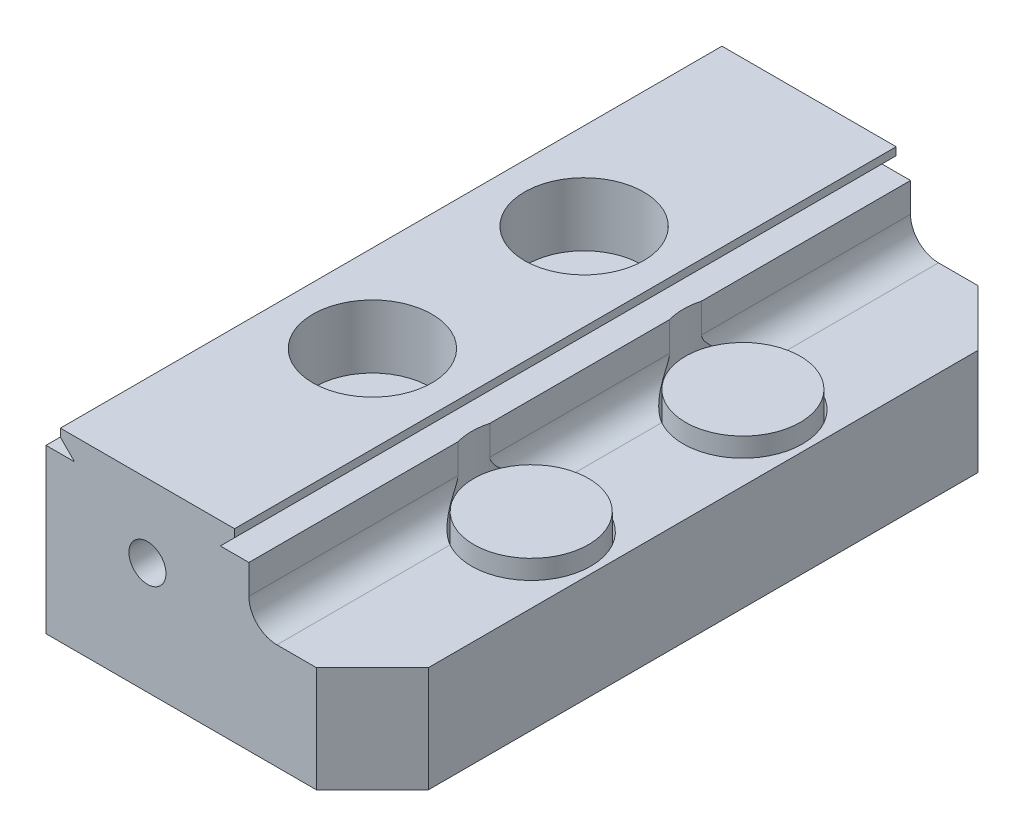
ISO-10303-21;
HEADER;
FILE_DESCRIPTION(('STEP AP214'),'2;1');
FILE_NAME('part.step','',(''),(''),'','','');
FILE_SCHEMA(('AUTOMOTIVE_DESIGN { 1 0 10303 214 1 1 1 1 }'));
ENDSEC;
DATA;
#1=APPLICATION_CONTEXT('core data for automotive mechanical design processes');
#2=APPLICATION_PROTOCOL_DEFINITION('international standard','automotive_design',2000,#1);
#3=PRODUCT_CONTEXT('',#1,'mechanical');
#4=PRODUCT('Part','Part','',(#3));
#5=PRODUCT_RELATED_PRODUCT_CATEGORY('part','',(#4));
#6=PRODUCT_DEFINITION_FORMATION('','',#4);
#7=PRODUCT_DEFINITION_CONTEXT('part definition',#1,'design');
#8=PRODUCT_DEFINITION('design','',#6,#7);
#9=PRODUCT_DEFINITION_SHAPE('','',#8);
#10=(LENGTH_UNIT() NAMED_UNIT(*) SI_UNIT(.MILLI.,.METRE.));
#11=(NAMED_UNIT(*) PLANE_ANGLE_UNIT() SI_UNIT($,.RADIAN.));
#12=(NAMED_UNIT(*) SI_UNIT($,.STERADIAN.) SOLID_ANGLE_UNIT());
#13=UNCERTAINTY_MEASURE_WITH_UNIT(LENGTH_MEASURE(1.E-05),#10,'distance_accuracy_value','');
#14=(GEOMETRIC_REPRESENTATION_CONTEXT(3) GLOBAL_UNCERTAINTY_ASSIGNED_CONTEXT((#13)) GLOBAL_UNIT_ASSIGNED_CONTEXT((#10,
#11,#12)) REPRESENTATION_CONTEXT('',''));
#15=CARTESIAN_POINT('',(0.,0.,0.));
#16=DIRECTION('',(0.,0.,1.));
#17=DIRECTION('',(1.,0.,0.));
#18=AXIS2_PLACEMENT_3D('',#15,#16,#17);
#19=CARTESIAN_POINT('',(26.175,15.175,37.5));
#20=DIRECTION('',(0.,0.,-1.));
#21=DIRECTION('',(-1.,0.,0.));
#22=AXIS2_PLACEMENT_3D('',#19,#20,#21);
#23=CYLINDRICAL_SURFACE('',#22,3.175);
#24=DIRECTION('',(0.,0.,-1.));
#25=VECTOR('',#24,1.);
#26=CARTESIAN_POINT('',(23.,15.175,37.5));
#27=LINE('',#26,#25);
#28=CARTESIAN_POINT('',(23.,15.175,-13.8200274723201));
#29=VERTEX_POINT('',#28);
#30=CARTESIAN_POINT('',(23.,15.175,-37.5));
#31=VERTEX_POINT('',#30);
#32=EDGE_CURVE('E443',#29,#31,#27,.T.);
#33=ORIENTED_EDGE('',*,*,#32,.F.);
#34=CARTESIAN_POINT('',(23.,15.175,-13.8200274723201));
#35=CARTESIAN_POINT('',(22.9999604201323,15.1198926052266,-13.8198230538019));
#36=CARTESIAN_POINT('',(23.0014321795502,15.0651093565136,-13.8251482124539));
#37=CARTESIAN_POINT('',(23.0069716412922,14.9582999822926,-13.8447873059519));
#38=CARTESIAN_POINT('',(23.010991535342,14.9062418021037,-13.8589356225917));
#39=CARTESIAN_POINT('',(23.0236021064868,14.7813863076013,-13.9024842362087));
#40=CARTESIAN_POINT('',(23.0334482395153,14.7101765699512,-13.9359155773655));
#41=CARTESIAN_POINT('',(23.0567939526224,14.5730841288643,-14.012268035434));
#42=CARTESIAN_POINT('',(23.0703289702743,14.5072615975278,-14.0552804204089));
#43=CARTESIAN_POINT('',(23.106677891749,14.3536358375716,-14.1662407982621));
#44=CARTESIAN_POINT('',(23.1309960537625,14.2682952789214,-14.2370461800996));
#45=CARTESIAN_POINT('',(23.1847003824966,14.1044135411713,-14.3844734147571));
#46=CARTESIAN_POINT('',(23.2140973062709,14.0258873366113,-14.4611074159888));
#47=CARTESIAN_POINT('',(23.2776989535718,13.8738169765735,-14.6177545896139));
#48=CARTESIAN_POINT('',(23.3119186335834,13.8002894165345,-14.6977777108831));
#49=CARTESIAN_POINT('',(23.3849318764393,13.6575831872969,-14.8594259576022));
#50=CARTESIAN_POINT('',(23.4237216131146,13.5884009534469,-14.9410496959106));
#51=CARTESIAN_POINT('',(23.5313207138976,13.412071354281,-15.1558508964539));
#52=CARTESIAN_POINT('',(23.6038482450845,13.3079348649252,-15.289661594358));
#53=CARTESIAN_POINT('',(23.7611169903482,13.108627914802,-15.5569409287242));
#54=CARTESIAN_POINT('',(23.8458672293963,13.0134641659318,-15.6904092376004));
#55=CARTESIAN_POINT('',(24.0276053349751,12.8328481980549,-15.9548760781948));
#56=CARTESIAN_POINT('',(24.1245562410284,12.7473680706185,-16.0858807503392));
#57=CARTESIAN_POINT('',(24.3311421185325,12.5869650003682,-16.3442854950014));
#58=CARTESIAN_POINT('',(24.4407773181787,12.5120422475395,-16.4716855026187));
#59=CARTESIAN_POINT('',(24.7127713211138,12.3509448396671,-16.7641530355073));
#60=CARTESIAN_POINT('',(24.8803498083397,12.2696644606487,-16.9272274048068));
#61=CARTESIAN_POINT('',(25.1482546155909,12.1690923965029,-17.1612865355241));
#62=CARTESIAN_POINT('',(25.2401917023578,12.139149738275,-17.237462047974));
#63=CARTESIAN_POINT('',(25.4293742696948,12.087236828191,-17.3858081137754));
#64=CARTESIAN_POINT('',(25.526616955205,12.0652624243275,-17.4579807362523));
#65=CARTESIAN_POINT('',(25.7142314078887,12.032344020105,-17.589452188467));
#66=CARTESIAN_POINT('',(25.8040662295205,12.0204067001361,-17.6492668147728));
#67=CARTESIAN_POINT('',(25.9871409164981,12.0042276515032,-17.7649044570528));
#68=CARTESIAN_POINT('',(26.0803861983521,11.9999987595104,-17.8207206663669));
#69=CARTESIAN_POINT('',(26.175,12.,-17.8742552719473));
#70=B_SPLINE_CURVE_WITH_KNOTS('',3,(#34,#35,#36,#37,#38,#39,#40,#41,#42,#43,#44,#45,#46,#47,#48,
#49,#50,#51,#52,#53,#54,#55,#56,#57,#58,#59,#60,#61,#62,#63,#64,#65,#66,#67,#68,#69),
.UNSPECIFIED.,.F.,.F.,(4,2,2,2,2,2,2,2,2,2,2,2,2,2,2,2,2,4),(0.,0.164529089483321,
0.326059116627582,0.562554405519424,0.801406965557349,1.14117317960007,1.4816680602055,
1.82324313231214,2.16453423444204,2.71710856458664,3.27009301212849,3.82144086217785,
4.37279863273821,5.11243321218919,5.48136248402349,5.85009924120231,6.17546973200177,
6.50138156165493),.UNSPECIFIED.);
#71=CARTESIAN_POINT('',(26.175,12.,-17.8742552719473));
#72=VERTEX_POINT('',#71);
#73=EDGE_CURVE('E354',#29,#72,#70,.T.);
#74=ORIENTED_EDGE('',*,*,#73,.T.);
#75=DIRECTION('',(0.,0.,-1.));
#76=VECTOR('',#75,1.);
#77=CARTESIAN_POINT('',(26.175,12.,37.5));
#78=LINE('',#77,#76);
#79=CARTESIAN_POINT('',(26.175,12.,-37.5));
#80=VERTEX_POINT('',#79);
#81=EDGE_CURVE('E448',#72,#80,#78,.T.);
#82=ORIENTED_EDGE('',*,*,#81,.T.);
#83=CARTESIAN_POINT('',(26.175,15.175,-37.5));
#84=DIRECTION('',(0.,0.,-1.));
#85=DIRECTION('',(1.,0.,0.));
#86=AXIS2_PLACEMENT_3D('',#83,#84,#85);
#87=CIRCLE('',#86,3.175);
#88=EDGE_CURVE('E400',#80,#31,#87,.T.);
#89=ORIENTED_EDGE('',*,*,#88,.T.);
#90=EDGE_LOOP('',(#33,#74,#82,#89));
#91=FACE_BOUND('',#90,.T.);
#92=ADVANCED_FACE('F16',(#91),#23,.F.);
#93=CARTESIAN_POINT('',(26.175,12.,6.12574472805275));
#94=VERTEX_POINT('',#93);
#95=CARTESIAN_POINT('',(26.175,12.,-6.12574472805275));
#96=VERTEX_POINT('',#95);
#97=EDGE_CURVE('E454',#94,#96,#78,.T.);
#98=ORIENTED_EDGE('',*,*,#97,.T.);
#99=CARTESIAN_POINT('',(26.175,12.,-6.12574472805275));
#100=CARTESIAN_POINT('',(26.0554497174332,11.9999995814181,-6.1933653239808));
#101=CARTESIAN_POINT('',(25.9381345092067,12.0067473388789,-6.26463219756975));
#102=CARTESIAN_POINT('',(25.7092088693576,12.0322484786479,-6.41333435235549));
#103=CARTESIAN_POINT('',(25.5975856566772,12.0509735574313,-6.49075471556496));
#104=CARTESIAN_POINT('',(25.3823102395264,12.0985976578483,-6.64978247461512));
#105=CARTESIAN_POINT('',(25.2785645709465,12.1273421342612,-6.73131102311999));
#106=CARTESIAN_POINT('',(25.0776404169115,12.1937872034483,-6.89878985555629));
#107=CARTESIAN_POINT('',(24.9804663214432,12.2314937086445,-6.98474302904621));
#108=CARTESIAN_POINT('',(24.7775413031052,12.3215793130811,-7.17472724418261));
#109=CARTESIAN_POINT('',(24.6730153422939,12.3753523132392,-7.27940343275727));
#110=CARTESIAN_POINT('',(24.473387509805,12.4919963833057,-7.4925619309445));
#111=CARTESIAN_POINT('',(24.3782865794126,12.5548683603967,-7.60104461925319));
#112=CARTESIAN_POINT('',(24.1966848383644,12.6890901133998,-7.82173086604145));
#113=CARTESIAN_POINT('',(24.1102603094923,12.7605047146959,-7.93395751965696));
#114=CARTESIAN_POINT('',(23.9467435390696,12.9105334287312,-8.16029550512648));
#115=CARTESIAN_POINT('',(23.8696489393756,12.9891457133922,-8.27440635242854));
#116=CARTESIAN_POINT('',(23.7222644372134,13.1557235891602,-8.50717434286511));
#117=CARTESIAN_POINT('',(23.6522669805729,13.2439064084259,-8.62586110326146));
#118=CARTESIAN_POINT('',(23.5217109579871,13.4276026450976,-8.86297907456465));
#119=CARTESIAN_POINT('',(23.4611625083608,13.5231237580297,-8.98140987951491));
#120=CARTESIAN_POINT('',(23.3498895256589,13.7216298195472,-9.21518170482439));
#121=CARTESIAN_POINT('',(23.2991014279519,13.8245600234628,-9.33053818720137));
#122=CARTESIAN_POINT('',(23.2301845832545,13.986680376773,-9.49887841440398));
#123=CARTESIAN_POINT('',(23.2084392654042,14.0419555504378,-9.55416243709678));
#124=CARTESIAN_POINT('',(23.167460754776,14.1556900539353,-9.66231378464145));
#125=CARTESIAN_POINT('',(23.1482262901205,14.2141477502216,-9.71518232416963));
#126=CARTESIAN_POINT('',(23.1127099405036,14.3342410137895,-9.81645613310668));
#127=CARTESIAN_POINT('',(23.0963909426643,14.3958215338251,-9.86491296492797));
#128=CARTESIAN_POINT('',(23.066760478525,14.5240020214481,-9.95593418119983));
#129=CARTESIAN_POINT('',(23.0534478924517,14.5906001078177,-9.99850075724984));
#130=CARTESIAN_POINT('',(23.0335018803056,14.7120066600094,-10.0640852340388));
#131=CARTESIAN_POINT('',(23.0260311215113,14.7654565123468,-10.0893167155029));
#132=CARTESIAN_POINT('',(23.0136624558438,14.8756478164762,-10.131734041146));
#133=CARTESIAN_POINT('',(23.0087535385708,14.9323739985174,-10.148954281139));
#134=CARTESIAN_POINT('',(23.0036143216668,15.0205356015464,-10.167101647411));
#135=CARTESIAN_POINT('',(23.0022692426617,15.0511266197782,-10.1718824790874));
#136=CARTESIAN_POINT('',(23.0004575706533,15.112800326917,-10.1783381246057));
#137=CARTESIAN_POINT('',(22.9999950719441,15.1438846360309,-10.1799984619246));
#138=CARTESIAN_POINT('',(23.,15.175,-10.1799725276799));
#139=B_SPLINE_CURVE_WITH_KNOTS('',3,(#99,#100,#101,#102,#103,#104,#105,#106,#107,#108,#109,#110,
#111,#112,#113,#114,#115,#116,#117,#118,#119,#120,#121,#122,#123,#124,#125,#126,#127,#128,#129,
#130,#131,#132,#133,#134,#135,#136,#137,#138),.UNSPECIFIED.,.F.,.F.,(4,2,2,2,2,2,2,2,2,2,2,2,2,
2,2,2,2,2,2,4),(0.,0.411600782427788,0.822232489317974,1.22679184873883,1.63161884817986,
2.10314870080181,2.57472559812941,3.05013999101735,3.52543397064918,4.01576489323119,
4.50661722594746,4.9941556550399,5.23749349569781,5.48070759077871,5.72056228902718,
5.96032750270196,6.13858208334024,6.31606410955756,6.40887954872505,6.50212452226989),.UNSPECIFIED.);
#140=CARTESIAN_POINT('',(23.,15.175,-10.1799725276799));
#141=VERTEX_POINT('',#140);
#142=EDGE_CURVE('E347',#96,#141,#139,.T.);
#143=ORIENTED_EDGE('',*,*,#142,.T.);
#144=CARTESIAN_POINT('',(23.,15.175,10.1799725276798));
#145=VERTEX_POINT('',#144);
#146=EDGE_CURVE('E449',#145,#141,#27,.T.);
#147=ORIENTED_EDGE('',*,*,#146,.F.);
#148=CARTESIAN_POINT('',(23.,15.175,10.1799725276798));
#149=CARTESIAN_POINT('',(22.9999604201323,15.1198926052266,10.1801769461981));
#150=CARTESIAN_POINT('',(23.0014321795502,15.0651093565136,10.1748517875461));
#151=CARTESIAN_POINT('',(23.0069716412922,14.9582999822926,10.1552126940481));
#152=CARTESIAN_POINT('',(23.010991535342,14.9062418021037,10.1410643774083));
#153=CARTESIAN_POINT('',(23.0236021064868,14.7813863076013,10.0975157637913));
#154=CARTESIAN_POINT('',(23.0334482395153,14.7101765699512,10.0640844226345));
#155=CARTESIAN_POINT('',(23.0567939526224,14.5730841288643,9.98773196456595));
#156=CARTESIAN_POINT('',(23.0703289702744,14.5072615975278,9.94471957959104));
#157=CARTESIAN_POINT('',(23.1066778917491,14.3536358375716,9.83375920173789));
#158=CARTESIAN_POINT('',(23.1309960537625,14.2682952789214,9.76295381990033));
#159=CARTESIAN_POINT('',(23.1847003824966,14.1044135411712,9.61552658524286));
#160=CARTESIAN_POINT('',(23.2140973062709,14.0258873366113,9.53889258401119));
#161=CARTESIAN_POINT('',(23.2776989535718,13.8738169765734,9.38224541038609));
#162=CARTESIAN_POINT('',(23.3119186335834,13.8002894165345,9.30222228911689));
#163=CARTESIAN_POINT('',(23.3849318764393,13.6575831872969,9.14057404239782));
#164=CARTESIAN_POINT('',(23.4237216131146,13.5884009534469,9.05895030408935));
#165=CARTESIAN_POINT('',(23.5313207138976,13.412071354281,8.8441491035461));
#166=CARTESIAN_POINT('',(23.6038482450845,13.3079348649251,8.710338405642));
#167=CARTESIAN_POINT('',(23.7611169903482,13.108627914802,8.44305907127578));
#168=CARTESIAN_POINT('',(23.8458672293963,13.0134641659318,8.30959076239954));
#169=CARTESIAN_POINT('',(24.0276053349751,12.8328481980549,8.04512392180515));
#170=CARTESIAN_POINT('',(24.1245562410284,12.7473680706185,7.91411924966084));
#171=CARTESIAN_POINT('',(24.3311421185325,12.5869650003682,7.65571450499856));
#172=CARTESIAN_POINT('',(24.4407773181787,12.5120422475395,7.52831449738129));
#173=CARTESIAN_POINT('',(24.7127713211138,12.3509448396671,7.23584696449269));
#174=CARTESIAN_POINT('',(24.8803498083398,12.2696644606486,7.07277259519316));
#175=CARTESIAN_POINT('',(25.1482546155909,12.1690923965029,6.83871346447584));
#176=CARTESIAN_POINT('',(25.2401917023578,12.139149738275,6.76253795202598));
#177=CARTESIAN_POINT('',(25.4293742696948,12.087236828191,6.61419188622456));
#178=CARTESIAN_POINT('',(25.526616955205,12.0652624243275,6.54201926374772));
#179=CARTESIAN_POINT('',(25.7142314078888,12.032344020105,6.410547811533));
#180=CARTESIAN_POINT('',(25.8040662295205,12.0204067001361,6.35073318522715));
#181=CARTESIAN_POINT('',(25.9871409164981,12.0042276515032,6.23509554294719));
#182=CARTESIAN_POINT('',(26.0803861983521,11.9999987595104,6.17927933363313));
#183=CARTESIAN_POINT('',(26.175,12.,6.12574472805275));
#184=B_SPLINE_CURVE_WITH_KNOTS('',3,(#148,#149,#150,#151,#152,#153,#154,#155,#156,#157,#158,
#159,#160,#161,#162,#163,#164,#165,#166,#167,#168,#169,#170,#171,#172,#173,#174,#175,#176,#177,
#178,#179,#180,#181,#182,#183),.UNSPECIFIED.,.F.,.F.,(4,2,2,2,2,2,2,2,2,2,2,2,2,2,2,2,2,4),(0.,
0.164529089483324,0.326059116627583,0.56255440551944,0.801406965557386,1.14117317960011,
1.48166806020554,1.82324313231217,2.16453423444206,2.71710856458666,3.2700930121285,
3.82144086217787,4.37279863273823,5.11243321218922,5.48136248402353,5.85009924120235,
6.17546973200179,6.50138156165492),.UNSPECIFIED.);
#185=EDGE_CURVE('E313',#145,#94,#184,.T.);
#186=ORIENTED_EDGE('',*,*,#185,.T.);
#187=EDGE_LOOP('',(#98,#143,#147,#186));
#188=FACE_BOUND('',#187,.T.);
#189=ADVANCED_FACE('F522',(#188),#23,.F.);
#190=CARTESIAN_POINT('',(23.,18.5,37.5));
#191=DIRECTION('',(-1.,0.,0.));
#192=DIRECTION('',(0.,0.,1.));
#193=AXIS2_PLACEMENT_3D('',#190,#191,#192);
#194=PLANE('',#193);
#195=ORIENTED_EDGE('',*,*,#146,.T.);
#196=DIRECTION('',(0.,1.,0.));
#197=VECTOR('',#196,1.);
#198=CARTESIAN_POINT('',(23.,6.,-10.1799725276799));
#199=LINE('',#198,#197);
#200=CARTESIAN_POINT('',(23.,18.5,-10.1799725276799));
#201=VERTEX_POINT('',#200);
#202=EDGE_CURVE('E475',#141,#201,#199,.T.);
#203=ORIENTED_EDGE('',*,*,#202,.T.);
#204=DIRECTION('',(0.,0.,-1.));
#205=VECTOR('',#204,1.);
#206=CARTESIAN_POINT('',(23.,18.5,37.5));
#207=LINE('',#206,#205);
#208=CARTESIAN_POINT('',(23.,18.5,10.1799725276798));
#209=VERTEX_POINT('',#208);
#210=EDGE_CURVE('E444',#209,#201,#207,.T.);
#211=ORIENTED_EDGE('',*,*,#210,.F.);
#212=DIRECTION('',(0.,1.,0.));
#213=VECTOR('',#212,1.);
#214=CARTESIAN_POINT('',(23.,6.,10.1799725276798));
#215=LINE('',#214,#213);
#216=EDGE_CURVE('E296',#209,#145,#215,.F.);
#217=ORIENTED_EDGE('',*,*,#216,.T.);
#218=EDGE_LOOP('',(#195,#203,#211,#217));
#219=FACE_BOUND('',#218,.T.);
#220=ADVANCED_FACE('F473',(#219),#194,.F.);
#221=CARTESIAN_POINT('',(23.,15.175,37.5));
#222=VERTEX_POINT('',#221);
#223=CARTESIAN_POINT('',(23.,15.175,13.8200274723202));
#224=VERTEX_POINT('',#223);
#225=EDGE_CURVE('E445',#222,#224,#27,.T.);
#226=ORIENTED_EDGE('',*,*,#225,.T.);
#227=DIRECTION('',(0.,1.,0.));
#228=VECTOR('',#227,1.);
#229=CARTESIAN_POINT('',(23.,6.,13.8200274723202));
#230=LINE('',#229,#228);
#231=CARTESIAN_POINT('',(23.,18.5,13.8200274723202));
#232=VERTEX_POINT('',#231);
#233=EDGE_CURVE('E301',#224,#232,#230,.T.);
#234=ORIENTED_EDGE('',*,*,#233,.T.);
#235=CARTESIAN_POINT('',(23.,18.5,37.5));
#236=VERTEX_POINT('',#235);
#237=EDGE_CURVE('E440',#236,#232,#207,.T.);
#238=ORIENTED_EDGE('',*,*,#237,.F.);
#239=DIRECTION('',(0.,1.,0.));
#240=VECTOR('',#239,1.);
#241=CARTESIAN_POINT('',(23.,18.5,37.5));
#242=LINE('',#241,#240);
#243=EDGE_CURVE('E376',#222,#236,#242,.T.);
#244=ORIENTED_EDGE('',*,*,#243,.F.);
#245=EDGE_LOOP('',(#226,#234,#238,#244));
#246=FACE_BOUND('',#245,.T.);
#247=ADVANCED_FACE('F507',(#246),#194,.F.);
#248=CARTESIAN_POINT('',(0.,0.,37.5));
#249=DIRECTION('',(1.,0.,0.));
#250=DIRECTION('',(0.,0.,-1.));
#251=AXIS2_PLACEMENT_3D('',#248,#249,#250);
#252=PLANE('',#251);
#253=DIRECTION('',(0.,-1.,0.));
#254=VECTOR('',#253,1.);
#255=CARTESIAN_POINT('',(0.,0.,-37.5));
#256=LINE('',#255,#254);
#257=CARTESIAN_POINT('',(0.,18.5,-37.5));
#258=VERTEX_POINT('',#257);
#259=CARTESIAN_POINT('',(0.,0.,-37.5));
#260=VERTEX_POINT('',#259);
#261=EDGE_CURVE('E364',#258,#260,#256,.T.);
#262=ORIENTED_EDGE('',*,*,#261,.T.);
#263=DIRECTION('',(0.,0.,-1.));
#264=VECTOR('',#263,1.);
#265=CARTESIAN_POINT('',(0.,0.,37.5));
#266=LINE('',#265,#264);
#267=CARTESIAN_POINT('',(0.,0.,37.5));
#268=VERTEX_POINT('',#267);
#269=EDGE_CURVE('E460',#268,#260,#266,.T.);
#270=ORIENTED_EDGE('',*,*,#269,.F.);
#271=DIRECTION('',(0.,-1.,0.));
#272=VECTOR('',#271,1.);
#273=CARTESIAN_POINT('',(0.,0.,37.5));
#274=LINE('',#273,#272);
#275=CARTESIAN_POINT('',(0.,18.5,37.5));
#276=VERTEX_POINT('',#275);
#277=EDGE_CURVE('E365',#276,#268,#274,.T.);
#278=ORIENTED_EDGE('',*,*,#277,.F.);
#279=DIRECTION('',(0.,0.,-1.));
#280=VECTOR('',#279,1.);
#281=CARTESIAN_POINT('',(0.,18.5,37.5));
#282=LINE('',#281,#280);
#283=EDGE_CURVE('E392',#276,#258,#282,.T.);
#284=ORIENTED_EDGE('',*,*,#283,.T.);
#285=EDGE_LOOP('',(#262,#270,#278,#284));
#286=FACE_BOUND('',#285,.T.);
#287=ADVANCED_FACE('F18',(#286),#252,.F.);
#288=CARTESIAN_POINT('',(0.,0.,37.5));
#289=DIRECTION('',(0.,1.,0.));
#290=DIRECTION('',(0.,0.,1.));
#291=AXIS2_PLACEMENT_3D('',#288,#289,#290);
#292=PLANE('',#291);
#293=DIRECTION('',(0.,0.,1.));
#294=VECTOR('',#293,1.);
#295=CARTESIAN_POINT('',(24.0052,0.,-17.5));
#296=LINE('',#295,#294);
#297=CARTESIAN_POINT('',(24.0052,0.,-17.5));
#298=VERTEX_POINT('',#297);
#299=CARTESIAN_POINT('',(24.0052,0.,17.5));
#300=VERTEX_POINT('',#299);
#301=EDGE_CURVE('E215',#298,#300,#296,.T.);
#302=ORIENTED_EDGE('',*,*,#301,.F.);
#303=CARTESIAN_POINT('',(20.5,0.,-17.5));
#304=DIRECTION('',(0.,-1.,0.));
#305=DIRECTION('',(0.,0.,-1.));
#306=AXIS2_PLACEMENT_3D('',#303,#304,#305);
#307=CIRCLE('',#306,3.5052);
#308=CARTESIAN_POINT('',(16.9948,0.,-17.5));
#309=VERTEX_POINT('',#308);
#310=EDGE_CURVE('E31',#309,#298,#307,.T.);
#311=ORIENTED_EDGE('',*,*,#310,.F.);
#312=DIRECTION('',(0.,0.,-1.));
#313=VECTOR('',#312,1.);
#314=CARTESIAN_POINT('',(16.9948,0.,-17.5));
#315=LINE('',#314,#313);
#316=CARTESIAN_POINT('',(16.9948,0.,17.5));
#317=VERTEX_POINT('',#316);
#318=EDGE_CURVE('E203',#317,#309,#315,.T.);
#319=ORIENTED_EDGE('',*,*,#318,.F.);
#320=CARTESIAN_POINT('',(20.5,0.,17.5));
#321=DIRECTION('',(0.,-1.,0.));
#322=DIRECTION('',(0.,0.,-1.));
#323=AXIS2_PLACEMENT_3D('',#320,#321,#322);
#324=CIRCLE('',#323,3.5052);
#325=EDGE_CURVE('E206',#300,#317,#324,.T.);
#326=ORIENTED_EDGE('',*,*,#325,.F.);
#327=EDGE_LOOP('',(#302,#311,#319,#326));
#328=FACE_BOUND('',#327,.T.);
#329=DIRECTION('',(1.,0.,0.));
#330=VECTOR('',#329,1.);
#331=CARTESIAN_POINT('',(0.,0.,-37.5));
#332=LINE('',#331,#330);
#333=CARTESIAN_POINT('',(30.65,0.,-37.5));
#334=VERTEX_POINT('',#333);
#335=EDGE_CURVE('E395',#260,#334,#332,.T.);
#336=ORIENTED_EDGE('',*,*,#335,.T.);
#337=DIRECTION('',(0.707106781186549,0.,0.707106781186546));
#338=VECTOR('',#337,1.);
#339=CARTESIAN_POINT('',(30.65,0.,-37.5));
#340=LINE('',#339,#338);
#341=CARTESIAN_POINT('',(37.,0.,-31.15));
#342=VERTEX_POINT('',#341);
#343=EDGE_CURVE('E262',#334,#342,#340,.T.);
#344=ORIENTED_EDGE('',*,*,#343,.T.);
#345=DIRECTION('',(0.,0.,-1.));
#346=VECTOR('',#345,1.);
#347=CARTESIAN_POINT('',(37.,0.,37.5));
#348=LINE('',#347,#346);
#349=CARTESIAN_POINT('',(37.,0.,31.15));
#350=VERTEX_POINT('',#349);
#351=EDGE_CURVE('E457',#350,#342,#348,.T.);
#352=ORIENTED_EDGE('',*,*,#351,.F.);
#353=DIRECTION('',(-0.707106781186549,0.,0.707106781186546));
#354=VECTOR('',#353,1.);
#355=CARTESIAN_POINT('',(37.,0.,31.15));
#356=LINE('',#355,#354);
#357=CARTESIAN_POINT('',(30.65,0.,37.5));
#358=VERTEX_POINT('',#357);
#359=EDGE_CURVE('E259',#350,#358,#356,.T.);
#360=ORIENTED_EDGE('',*,*,#359,.T.);
#361=DIRECTION('',(1.,0.,0.));
#362=VECTOR('',#361,1.);
#363=CARTESIAN_POINT('',(0.,0.,37.5));
#364=LINE('',#363,#362);
#365=EDGE_CURVE('E368',#268,#358,#364,.T.);
#366=ORIENTED_EDGE('',*,*,#365,.F.);
#367=ORIENTED_EDGE('',*,*,#269,.T.);
#368=EDGE_LOOP('',(#336,#344,#352,#360,#366,#367));
#369=FACE_BOUND('',#368,.T.);
#370=ADVANCED_FACE('F531',(#328,#369),#292,.F.);
#371=CARTESIAN_POINT('',(37.,0.,37.5));
#372=DIRECTION('',(-1.,0.,0.));
#373=DIRECTION('',(0.,0.,1.));
#374=AXIS2_PLACEMENT_3D('',#371,#372,#373);
#375=PLANE('',#374);
#376=ORIENTED_EDGE('',*,*,#351,.T.);
#377=DIRECTION('',(0.,1.,0.));
#378=VECTOR('',#377,1.);
#379=CARTESIAN_POINT('',(37.,0.,-31.15));
#380=LINE('',#379,#378);
#381=CARTESIAN_POINT('',(37.,12.,-31.15));
#382=VERTEX_POINT('',#381);
#383=EDGE_CURVE('E267',#342,#382,#380,.T.);
#384=ORIENTED_EDGE('',*,*,#383,.T.);
#385=DIRECTION('',(0.,0.,-1.));
#386=VECTOR('',#385,1.);
#387=CARTESIAN_POINT('',(37.,12.,37.5));
#388=LINE('',#387,#386);
#389=CARTESIAN_POINT('',(37.,12.,31.15));
#390=VERTEX_POINT('',#389);
#391=EDGE_CURVE('E453',#390,#382,#388,.T.);
#392=ORIENTED_EDGE('',*,*,#391,.F.);
#393=DIRECTION('',(0.,1.,0.));
#394=VECTOR('',#393,1.);
#395=CARTESIAN_POINT('',(37.,0.,31.15));
#396=LINE('',#395,#394);
#397=EDGE_CURVE('E274',#350,#390,#396,.T.);
#398=ORIENTED_EDGE('',*,*,#397,.F.);
#399=EDGE_LOOP('',(#376,#384,#392,#398));
#400=FACE_BOUND('',#399,.T.);
#401=ADVANCED_FACE('F574',(#400),#375,.F.);
#402=CARTESIAN_POINT('',(37.,12.,37.5));
#403=DIRECTION('',(0.,-1.,0.));
#404=DIRECTION('',(1.,0.,0.));
#405=AXIS2_PLACEMENT_3D('',#402,#403,#404);
#406=PLANE('',#405);
#407=ORIENTED_EDGE('',*,*,#391,.T.);
#408=DIRECTION('',(-0.707106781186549,0.,-0.707106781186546));
#409=VECTOR('',#408,1.);
#410=CARTESIAN_POINT('',(71.325,12.,3.17499999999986));
#411=LINE('',#410,#409);
#412=CARTESIAN_POINT('',(30.65,12.,-37.5));
#413=VERTEX_POINT('',#412);
#414=EDGE_CURVE('E270',#382,#413,#411,.T.);
#415=ORIENTED_EDGE('',*,*,#414,.T.);
#416=DIRECTION('',(-1.,0.,0.));
#417=VECTOR('',#416,1.);
#418=CARTESIAN_POINT('',(37.,12.,-37.5));
#419=LINE('',#418,#417);
#420=EDGE_CURVE('E398',#413,#80,#419,.T.);
#421=ORIENTED_EDGE('',*,*,#420,.T.);
#422=ORIENTED_EDGE('',*,*,#81,.F.);
#423=CARTESIAN_POINT('',(29.5,12.,-12.));
#424=DIRECTION('',(0.,-1.,0.));
#425=DIRECTION('',(1.,0.,0.));
#426=AXIS2_PLACEMENT_3D('',#423,#424,#425);
#427=CIRCLE('',#426,6.75);
#428=EDGE_CURVE('E361',#72,#96,#427,.T.);
#429=ORIENTED_EDGE('',*,*,#428,.T.);
#430=ORIENTED_EDGE('',*,*,#97,.F.);
#431=CARTESIAN_POINT('',(29.5,12.,12.));
#432=DIRECTION('',(0.,-1.,0.));
#433=DIRECTION('',(1.,0.,0.));
#434=AXIS2_PLACEMENT_3D('',#431,#432,#433);
#435=CIRCLE('',#434,6.75);
#436=CARTESIAN_POINT('',(26.175,12.,17.8742552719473));
#437=VERTEX_POINT('',#436);
#438=EDGE_CURVE('E515',#94,#437,#435,.T.);
#439=ORIENTED_EDGE('',*,*,#438,.T.);
#440=CARTESIAN_POINT('',(26.175,12.,37.5));
#441=VERTEX_POINT('',#440);
#442=EDGE_CURVE('E450',#441,#437,#78,.T.);
#443=ORIENTED_EDGE('',*,*,#442,.F.);
#444=DIRECTION('',(-1.,0.,0.));
#445=VECTOR('',#444,1.);
#446=CARTESIAN_POINT('',(37.,12.,37.5));
#447=LINE('',#446,#445);
#448=CARTESIAN_POINT('',(30.65,12.,37.5));
#449=VERTEX_POINT('',#448);
#450=EDGE_CURVE('E372',#449,#441,#447,.T.);
#451=ORIENTED_EDGE('',*,*,#450,.F.);
#452=DIRECTION('',(0.707106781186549,0.,-0.707106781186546));
#453=VECTOR('',#452,1.);
#454=CARTESIAN_POINT('',(33.825,12.,34.325));
#455=LINE('',#454,#453);
#456=EDGE_CURVE('E39',#449,#390,#455,.T.);
#457=ORIENTED_EDGE('',*,*,#456,.T.);
#458=EDGE_LOOP('',(#407,#415,#421,#422,#429,#430,#439,#443,#451,#457));
#459=FACE_BOUND('',#458,.T.);
#460=ADVANCED_FACE('F513',(#459),#406,.F.);
#461=ORIENTED_EDGE('',*,*,#442,.T.);
#462=CARTESIAN_POINT('',(26.175,12.,17.8742552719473));
#463=CARTESIAN_POINT('',(26.0554497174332,11.9999995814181,17.8066346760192));
#464=CARTESIAN_POINT('',(25.9381345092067,12.0067473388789,17.7353678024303));
#465=CARTESIAN_POINT('',(25.7092088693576,12.0322484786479,17.5866656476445));
#466=CARTESIAN_POINT('',(25.5975856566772,12.0509735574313,17.509245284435));
#467=CARTESIAN_POINT('',(25.3823102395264,12.0985976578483,17.3502175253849));
#468=CARTESIAN_POINT('',(25.2785645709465,12.1273421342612,17.26868897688));
#469=CARTESIAN_POINT('',(25.0776404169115,12.1937872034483,17.1012101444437));
#470=CARTESIAN_POINT('',(24.9804663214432,12.2314937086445,17.0152569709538));
#471=CARTESIAN_POINT('',(24.7775413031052,12.3215793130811,16.8252727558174));
#472=CARTESIAN_POINT('',(24.6730153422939,12.3753523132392,16.7205965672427));
#473=CARTESIAN_POINT('',(24.473387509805,12.4919963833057,16.5074380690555));
#474=CARTESIAN_POINT('',(24.3782865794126,12.5548683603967,16.3989553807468));
#475=CARTESIAN_POINT('',(24.1966848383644,12.6890901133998,16.1782691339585));
#476=CARTESIAN_POINT('',(24.1102603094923,12.7605047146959,16.066042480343));
#477=CARTESIAN_POINT('',(23.9467435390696,12.9105334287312,15.8397044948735));
#478=CARTESIAN_POINT('',(23.8696489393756,12.9891457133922,15.7255936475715));
#479=CARTESIAN_POINT('',(23.7222644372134,13.1557235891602,15.4928256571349));
#480=CARTESIAN_POINT('',(23.6522669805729,13.2439064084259,15.3741388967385));
#481=CARTESIAN_POINT('',(23.5217109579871,13.4276026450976,15.1370209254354));
#482=CARTESIAN_POINT('',(23.4611625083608,13.5231237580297,15.0185901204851));
#483=CARTESIAN_POINT('',(23.3498895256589,13.7216298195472,14.7848182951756));
#484=CARTESIAN_POINT('',(23.2991014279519,13.8245600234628,14.6694618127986));
#485=CARTESIAN_POINT('',(23.2301845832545,13.986680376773,14.501121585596));
#486=CARTESIAN_POINT('',(23.2084392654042,14.0419555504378,14.4458375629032));
#487=CARTESIAN_POINT('',(23.167460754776,14.1556900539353,14.3376862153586));
#488=CARTESIAN_POINT('',(23.1482262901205,14.2141477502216,14.2848176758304));
#489=CARTESIAN_POINT('',(23.1127099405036,14.3342410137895,14.1835438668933));
#490=CARTESIAN_POINT('',(23.0963909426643,14.395821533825,14.135087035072));
#491=CARTESIAN_POINT('',(23.066760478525,14.5240020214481,14.0440658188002));
#492=CARTESIAN_POINT('',(23.0534478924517,14.5906001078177,14.0014992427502));
#493=CARTESIAN_POINT('',(23.0335018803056,14.7120066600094,13.9359147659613));
#494=CARTESIAN_POINT('',(23.0260311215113,14.7654565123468,13.9106832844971));
#495=CARTESIAN_POINT('',(23.0136624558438,14.8756478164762,13.868265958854));
#496=CARTESIAN_POINT('',(23.0087535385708,14.9323739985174,13.851045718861));
#497=CARTESIAN_POINT('',(23.0036143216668,15.0205356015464,13.832898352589));
#498=CARTESIAN_POINT('',(23.0022692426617,15.0511266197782,13.8281175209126));
#499=CARTESIAN_POINT('',(23.0004575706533,15.112800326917,13.8216618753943));
#500=CARTESIAN_POINT('',(22.9999950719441,15.1438846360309,13.8200015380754));
#501=CARTESIAN_POINT('',(23.,15.175,13.8200274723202));
#502=B_SPLINE_CURVE_WITH_KNOTS('',3,(#462,#463,#464,#465,#466,#467,#468,#469,#470,#471,#472,
#473,#474,#475,#476,#477,#478,#479,#480,#481,#482,#483,#484,#485,#486,#487,#488,#489,#490,#491,
#492,#493,#494,#495,#496,#497,#498,#499,#500,#501),.UNSPECIFIED.,.F.,.F.,(4,2,2,2,2,2,2,2,2,2,2,
2,2,2,2,2,2,2,2,4),(0.,0.411600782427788,0.822232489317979,1.22679184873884,1.63161884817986,
2.10314870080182,2.57472559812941,3.05013999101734,3.52543397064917,4.01576489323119,
4.50661722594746,4.9941556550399,5.23749349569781,5.4807075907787,5.72056228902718,
5.96032750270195,6.13858208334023,6.31606410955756,6.40887954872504,6.50212452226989),.UNSPECIFIED.);
#503=EDGE_CURVE('E304',#437,#224,#502,.T.);
#504=ORIENTED_EDGE('',*,*,#503,.T.);
#505=ORIENTED_EDGE('',*,*,#225,.F.);
#506=CARTESIAN_POINT('',(26.175,15.175,37.5));
#507=DIRECTION('',(0.,0.,-1.));
#508=DIRECTION('',(1.,0.,0.));
#509=AXIS2_PLACEMENT_3D('',#506,#507,#508);
#510=CIRCLE('',#509,3.175);
#511=EDGE_CURVE('E374',#441,#222,#510,.T.);
#512=ORIENTED_EDGE('',*,*,#511,.F.);
#513=EDGE_LOOP('',(#461,#504,#505,#512));
#514=FACE_BOUND('',#513,.T.);
#515=ADVANCED_FACE('F319',(#514),#23,.F.);
#516=CARTESIAN_POINT('',(23.,18.5,-13.8200274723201));
#517=VERTEX_POINT('',#516);
#518=CARTESIAN_POINT('',(23.,18.5,-37.5));
#519=VERTEX_POINT('',#518);
#520=EDGE_CURVE('E439',#517,#519,#207,.T.);
#521=ORIENTED_EDGE('',*,*,#520,.F.);
#522=DIRECTION('',(0.,1.,0.));
#523=VECTOR('',#522,1.);
#524=CARTESIAN_POINT('',(23.,6.,-13.8200274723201));
#525=LINE('',#524,#523);
#526=EDGE_CURVE('E518',#517,#29,#525,.F.);
#527=ORIENTED_EDGE('',*,*,#526,.T.);
#528=ORIENTED_EDGE('',*,*,#32,.T.);
#529=DIRECTION('',(0.,1.,0.));
#530=VECTOR('',#529,1.);
#531=CARTESIAN_POINT('',(23.,18.5,-37.5));
#532=LINE('',#531,#530);
#533=EDGE_CURVE('E403',#31,#519,#532,.T.);
#534=ORIENTED_EDGE('',*,*,#533,.T.);
#535=EDGE_LOOP('',(#521,#527,#528,#534));
#536=FACE_BOUND('',#535,.T.);
#537=ADVANCED_FACE('F482',(#536),#194,.F.);
#538=CARTESIAN_POINT('',(19.762,18.5,37.5));
#539=DIRECTION('',(0.,-1.,0.));
#540=DIRECTION('',(0.,0.,-1.));
#541=AXIS2_PLACEMENT_3D('',#538,#539,#540);
#542=PLANE('',#541);
#543=ORIENTED_EDGE('',*,*,#210,.T.);
#544=CARTESIAN_POINT('',(29.5,18.5,-12.));
#545=DIRECTION('',(0.,-1.,0.));
#546=DIRECTION('',(0.,0.,-1.));
#547=AXIS2_PLACEMENT_3D('',#544,#545,#546);
#548=CIRCLE('',#547,6.75);
#549=EDGE_CURVE('E11',#201,#517,#548,.T.);
#550=ORIENTED_EDGE('',*,*,#549,.T.);
#551=ORIENTED_EDGE('',*,*,#520,.T.);
#552=DIRECTION('',(-1.,0.,0.));
#553=VECTOR('',#552,1.);
#554=CARTESIAN_POINT('',(19.762,18.5,-37.5));
#555=LINE('',#554,#553);
#556=CARTESIAN_POINT('',(19.762,18.5,-37.5));
#557=VERTEX_POINT('',#556);
#558=EDGE_CURVE('E406',#519,#557,#555,.T.);
#559=ORIENTED_EDGE('',*,*,#558,.T.);
#560=DIRECTION('',(0.,0.,-1.));
#561=VECTOR('',#560,1.);
#562=CARTESIAN_POINT('',(19.762,18.5,37.5));
#563=LINE('',#562,#561);
#564=CARTESIAN_POINT('',(19.762,18.5,37.5));
#565=VERTEX_POINT('',#564);
#566=EDGE_CURVE('E436',#565,#557,#563,.T.);
#567=ORIENTED_EDGE('',*,*,#566,.F.);
#568=DIRECTION('',(-1.,0.,0.));
#569=VECTOR('',#568,1.);
#570=CARTESIAN_POINT('',(19.762,18.5,37.5));
#571=LINE('',#570,#569);
#572=EDGE_CURVE('E378',#236,#565,#571,.T.);
#573=ORIENTED_EDGE('',*,*,#572,.F.);
#574=ORIENTED_EDGE('',*,*,#237,.T.);
#575=CARTESIAN_POINT('',(29.5,18.5,12.));
#576=DIRECTION('',(0.,-1.,0.));
#577=DIRECTION('',(0.,0.,-1.));
#578=AXIS2_PLACEMENT_3D('',#575,#576,#577);
#579=CIRCLE('',#578,6.75);
#580=EDGE_CURVE('E24',#232,#209,#579,.T.);
#581=ORIENTED_EDGE('',*,*,#580,.T.);
#582=EDGE_LOOP('',(#543,#550,#551,#559,#567,#573,#574,#581));
#583=FACE_BOUND('',#582,.T.);
#584=ADVANCED_FACE('F466',(#583),#542,.F.);
#585=CARTESIAN_POINT('',(21.373,20.111,37.5));
#586=DIRECTION('',(-0.707106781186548,0.707106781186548,0.));
#587=DIRECTION('',(-0.707106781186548,-0.707106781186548,0.));
#588=AXIS2_PLACEMENT_3D('',#585,#586,#587);
#589=PLANE('',#588);
#590=DIRECTION('',(0.707106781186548,0.707106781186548,0.));
#591=VECTOR('',#590,1.);
#592=CARTESIAN_POINT('',(21.373,20.111,-37.5));
#593=LINE('',#592,#591);
#594=CARTESIAN_POINT('',(21.373,20.111,-37.5));
#595=VERTEX_POINT('',#594);
#596=EDGE_CURVE('E408',#557,#595,#593,.T.);
#597=ORIENTED_EDGE('',*,*,#596,.T.);
#598=DIRECTION('',(0.,0.,-1.));
#599=VECTOR('',#598,1.);
#600=CARTESIAN_POINT('',(21.373,20.111,37.5));
#601=LINE('',#600,#599);
#602=CARTESIAN_POINT('',(21.373,20.111,37.5));
#603=VERTEX_POINT('',#602);
#604=EDGE_CURVE('E433',#603,#595,#601,.T.);
#605=ORIENTED_EDGE('',*,*,#604,.F.);
#606=DIRECTION('',(0.707106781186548,0.707106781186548,0.));
#607=VECTOR('',#606,1.);
#608=CARTESIAN_POINT('',(21.373,20.111,37.5));
#609=LINE('',#608,#607);
#610=EDGE_CURVE('E380',#565,#603,#609,.T.);
#611=ORIENTED_EDGE('',*,*,#610,.F.);
#612=ORIENTED_EDGE('',*,*,#566,.T.);
#613=EDGE_LOOP('',(#597,#605,#611,#612));
#614=FACE_BOUND('',#613,.T.);
#615=ADVANCED_FACE('F493',(#614),#589,.F.);
#616=CARTESIAN_POINT('',(21.373,21.,37.5));
#617=DIRECTION('',(-1.,0.,0.));
#618=DIRECTION('',(0.,0.,1.));
#619=AXIS2_PLACEMENT_3D('',#616,#617,#618);
#620=PLANE('',#619);
#621=DIRECTION('',(0.,1.,0.));
#622=VECTOR('',#621,1.);
#623=CARTESIAN_POINT('',(21.373,21.,-37.5));
#624=LINE('',#623,#622);
#625=CARTESIAN_POINT('',(21.373,21.,-37.5));
#626=VERTEX_POINT('',#625);
#627=EDGE_CURVE('E410',#595,#626,#624,.T.);
#628=ORIENTED_EDGE('',*,*,#627,.T.);
#629=DIRECTION('',(0.,0.,-1.));
#630=VECTOR('',#629,1.);
#631=CARTESIAN_POINT('',(21.373,21.,37.5));
#632=LINE('',#631,#630);
#633=CARTESIAN_POINT('',(21.373,21.,37.5));
#634=VERTEX_POINT('',#633);
#635=EDGE_CURVE('E430',#634,#626,#632,.T.);
#636=ORIENTED_EDGE('',*,*,#635,.F.);
#637=DIRECTION('',(0.,1.,0.));
#638=VECTOR('',#637,1.);
#639=CARTESIAN_POINT('',(21.373,21.,37.5));
#640=LINE('',#639,#638);
#641=EDGE_CURVE('E382',#603,#634,#640,.T.);
#642=ORIENTED_EDGE('',*,*,#641,.F.);
#643=ORIENTED_EDGE('',*,*,#604,.T.);
#644=EDGE_LOOP('',(#628,#636,#642,#643));
#645=FACE_BOUND('',#644,.T.);
#646=ADVANCED_FACE('F497',(#645),#620,.F.);
#647=CARTESIAN_POINT('',(1.627,21.,37.5));
#648=DIRECTION('',(0.,-1.,0.));
#649=DIRECTION('',(0.,0.,-1.));
#650=AXIS2_PLACEMENT_3D('',#647,#648,#649);
#651=PLANE('',#650);
#652=CARTESIAN_POINT('',(11.5,21.,12.));
#653=DIRECTION('',(0.,1.,0.));
#654=DIRECTION('',(0.,0.,1.));
#655=AXIS2_PLACEMENT_3D('',#652,#653,#654);
#656=CIRCLE('',#655,6.75);
#657=CARTESIAN_POINT('',(11.5,21.,18.75));
#658=VERTEX_POINT('',#657);
#659=EDGE_CURVE('E285',#658,#658,#656,.T.);
#660=ORIENTED_EDGE('',*,*,#659,.F.);
#661=EDGE_LOOP('',(#660));
#662=FACE_BOUND('',#661,.T.);
#663=CARTESIAN_POINT('',(11.5,21.,-12.));
#664=DIRECTION('',(0.,1.,0.));
#665=DIRECTION('',(0.,0.,1.));
#666=AXIS2_PLACEMENT_3D('',#663,#664,#665);
#667=CIRCLE('',#666,6.75);
#668=CARTESIAN_POINT('',(11.5,21.,-5.25));
#669=VERTEX_POINT('',#668);
#670=EDGE_CURVE('E284',#669,#669,#667,.T.);
#671=ORIENTED_EDGE('',*,*,#670,.F.);
#672=EDGE_LOOP('',(#671));
#673=FACE_BOUND('',#672,.T.);
#674=DIRECTION('',(-1.,0.,0.));
#675=VECTOR('',#674,1.);
#676=CARTESIAN_POINT('',(1.627,21.,-37.5));
#677=LINE('',#676,#675);
#678=CARTESIAN_POINT('',(1.627,21.,-37.5));
#679=VERTEX_POINT('',#678);
#680=EDGE_CURVE('E412',#626,#679,#677,.T.);
#681=ORIENTED_EDGE('',*,*,#680,.T.);
#682=DIRECTION('',(0.,0.,-1.));
#683=VECTOR('',#682,1.);
#684=CARTESIAN_POINT('',(1.627,21.,37.5));
#685=LINE('',#684,#683);
#686=CARTESIAN_POINT('',(1.627,21.,37.5));
#687=VERTEX_POINT('',#686);
#688=EDGE_CURVE('E427',#687,#679,#685,.T.);
#689=ORIENTED_EDGE('',*,*,#688,.F.);
#690=DIRECTION('',(-1.,0.,0.));
#691=VECTOR('',#690,1.);
#692=CARTESIAN_POINT('',(1.627,21.,37.5));
#693=LINE('',#692,#691);
#694=EDGE_CURVE('E384',#634,#687,#693,.T.);
#695=ORIENTED_EDGE('',*,*,#694,.F.);
#696=ORIENTED_EDGE('',*,*,#635,.T.);
#697=EDGE_LOOP('',(#681,#689,#695,#696));
#698=FACE_BOUND('',#697,.T.);
#699=ADVANCED_FACE('F552',(#662,#673,#698),#651,.F.);
#700=CARTESIAN_POINT('',(1.627,21.,37.5));
#701=DIRECTION('',(1.,0.,0.));
#702=DIRECTION('',(0.,1.,0.));
#703=AXIS2_PLACEMENT_3D('',#700,#701,#702);
#704=PLANE('',#703);
#705=DIRECTION('',(0.,-1.,0.));
#706=VECTOR('',#705,1.);
#707=CARTESIAN_POINT('',(1.627,21.,-37.5));
#708=LINE('',#707,#706);
#709=CARTESIAN_POINT('',(1.627,20.111,-37.5));
#710=VERTEX_POINT('',#709);
#711=EDGE_CURVE('E414',#679,#710,#708,.T.);
#712=ORIENTED_EDGE('',*,*,#711,.T.);
#713=DIRECTION('',(0.,0.,-1.));
#714=VECTOR('',#713,1.);
#715=CARTESIAN_POINT('',(1.627,20.111,37.5));
#716=LINE('',#715,#714);
#717=CARTESIAN_POINT('',(1.627,20.111,37.5));
#718=VERTEX_POINT('',#717);
#719=EDGE_CURVE('E424',#718,#710,#716,.T.);
#720=ORIENTED_EDGE('',*,*,#719,.F.);
#721=DIRECTION('',(0.,-1.,0.));
#722=VECTOR('',#721,1.);
#723=CARTESIAN_POINT('',(1.627,21.,37.5));
#724=LINE('',#723,#722);
#725=EDGE_CURVE('E386',#687,#718,#724,.T.);
#726=ORIENTED_EDGE('',*,*,#725,.F.);
#727=ORIENTED_EDGE('',*,*,#688,.T.);
#728=EDGE_LOOP('',(#712,#720,#726,#727));
#729=FACE_BOUND('',#728,.T.);
#730=ADVANCED_FACE('F550',(#729),#704,.F.);
#731=CARTESIAN_POINT('',(3.238,18.5,37.5));
#732=DIRECTION('',(0.707106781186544,0.707106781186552,0.));
#733=DIRECTION('',(-0.707106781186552,0.707106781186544,0.));
#734=AXIS2_PLACEMENT_3D('',#731,#732,#733);
#735=PLANE('',#734);
#736=DIRECTION('',(0.707106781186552,-0.707106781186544,0.));
#737=VECTOR('',#736,1.);
#738=CARTESIAN_POINT('',(3.238,18.5,-37.5));
#739=LINE('',#738,#737);
#740=CARTESIAN_POINT('',(3.238,18.5,-37.5));
#741=VERTEX_POINT('',#740);
#742=EDGE_CURVE('E416',#710,#741,#739,.T.);
#743=ORIENTED_EDGE('',*,*,#742,.T.);
#744=DIRECTION('',(0.,0.,-1.));
#745=VECTOR('',#744,1.);
#746=CARTESIAN_POINT('',(3.238,18.5,37.5));
#747=LINE('',#746,#745);
#748=CARTESIAN_POINT('',(3.238,18.5,37.5));
#749=VERTEX_POINT('',#748);
#750=EDGE_CURVE('E421',#749,#741,#747,.T.);
#751=ORIENTED_EDGE('',*,*,#750,.F.);
#752=DIRECTION('',(0.707106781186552,-0.707106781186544,0.));
#753=VECTOR('',#752,1.);
#754=CARTESIAN_POINT('',(3.238,18.5,37.5));
#755=LINE('',#754,#753);
#756=EDGE_CURVE('E388',#718,#749,#755,.T.);
#757=ORIENTED_EDGE('',*,*,#756,.F.);
#758=ORIENTED_EDGE('',*,*,#719,.T.);
#759=EDGE_LOOP('',(#743,#751,#757,#758));
#760=FACE_BOUND('',#759,.T.);
#761=ADVANCED_FACE('F546',(#760),#735,.F.);
#762=CARTESIAN_POINT('',(0.,18.5,37.5));
#763=DIRECTION('',(0.,-1.,0.));
#764=DIRECTION('',(0.,0.,-1.));
#765=AXIS2_PLACEMENT_3D('',#762,#763,#764);
#766=PLANE('',#765);
#767=DIRECTION('',(-1.,0.,0.));
#768=VECTOR('',#767,1.);
#769=CARTESIAN_POINT('',(0.,18.5,-37.5));
#770=LINE('',#769,#768);
#771=EDGE_CURVE('E369',#741,#258,#770,.T.);
#772=ORIENTED_EDGE('',*,*,#771,.T.);
#773=ORIENTED_EDGE('',*,*,#283,.F.);
#774=DIRECTION('',(-1.,0.,0.));
#775=VECTOR('',#774,1.);
#776=CARTESIAN_POINT('',(0.,18.5,37.5));
#777=LINE('',#776,#775);
#778=EDGE_CURVE('E390',#749,#276,#777,.T.);
#779=ORIENTED_EDGE('',*,*,#778,.F.);
#780=ORIENTED_EDGE('',*,*,#750,.T.);
#781=EDGE_LOOP('',(#772,#773,#779,#780));
#782=FACE_BOUND('',#781,.T.);
#783=ADVANCED_FACE('F541',(#782),#766,.F.);
#784=CARTESIAN_POINT('',(26.175,15.175,37.5));
#785=DIRECTION('',(0.,0.,1.));
#786=DIRECTION('',(1.,0.,0.));
#787=AXIS2_PLACEMENT_3D('',#784,#785,#786);
#788=PLANE('',#787);
#789=CARTESIAN_POINT('',(11.5,12.7,37.5));
#790=DIRECTION('',(0.,0.,1.));
#791=DIRECTION('',(1.,0.,0.));
#792=AXIS2_PLACEMENT_3D('',#789,#790,#791);
#793=CIRCLE('',#792,2.1);
#794=CARTESIAN_POINT('',(13.6,12.7,37.5));
#795=VERTEX_POINT('',#794);
#796=EDGE_CURVE('E253',#795,#795,#793,.T.);
#797=ORIENTED_EDGE('',*,*,#796,.F.);
#798=EDGE_LOOP('',(#797));
#799=FACE_BOUND('',#798,.T.);
#800=DIRECTION('',(0.,1.,0.));
#801=VECTOR('',#800,1.);
#802=CARTESIAN_POINT('',(30.65,0.,37.5));
#803=LINE('',#802,#801);
#804=EDGE_CURVE('E266',#358,#449,#803,.T.);
#805=ORIENTED_EDGE('',*,*,#804,.T.);
#806=ORIENTED_EDGE('',*,*,#450,.T.);
#807=ORIENTED_EDGE('',*,*,#511,.T.);
#808=ORIENTED_EDGE('',*,*,#243,.T.);
#809=ORIENTED_EDGE('',*,*,#572,.T.);
#810=ORIENTED_EDGE('',*,*,#610,.T.);
#811=ORIENTED_EDGE('',*,*,#641,.T.);
#812=ORIENTED_EDGE('',*,*,#694,.T.);
#813=ORIENTED_EDGE('',*,*,#725,.T.);
#814=ORIENTED_EDGE('',*,*,#756,.T.);
#815=ORIENTED_EDGE('',*,*,#778,.T.);
#816=ORIENTED_EDGE('',*,*,#277,.T.);
#817=ORIENTED_EDGE('',*,*,#365,.T.);
#818=EDGE_LOOP('',(#805,#806,#807,#808,#809,#810,#811,#812,#813,#814,#815,#816,#817));
#819=FACE_BOUND('',#818,.T.);
#820=ADVANCED_FACE('F501',(#799,#819),#788,.T.);
#821=CARTESIAN_POINT('',(26.175,15.175,-37.5));
#822=DIRECTION('',(0.,0.,1.));
#823=DIRECTION('',(1.,0.,0.));
#824=AXIS2_PLACEMENT_3D('',#821,#822,#823);
#825=PLANE('',#824);
#826=CARTESIAN_POINT('',(11.5,12.7,-37.5));
#827=DIRECTION('',(0.,0.,1.));
#828=DIRECTION('',(1.,0.,0.));
#829=AXIS2_PLACEMENT_3D('',#826,#827,#828);
#830=CIRCLE('',#829,2.1);
#831=CARTESIAN_POINT('',(13.6,12.7,-37.5));
#832=VERTEX_POINT('',#831);
#833=EDGE_CURVE('E247',#832,#832,#830,.T.);
#834=ORIENTED_EDGE('',*,*,#833,.T.);
#835=EDGE_LOOP('',(#834));
#836=FACE_BOUND('',#835,.T.);
#837=ORIENTED_EDGE('',*,*,#420,.F.);
#838=DIRECTION('',(0.,1.,0.));
#839=VECTOR('',#838,1.);
#840=CARTESIAN_POINT('',(30.65,0.,-37.5));
#841=LINE('',#840,#839);
#842=EDGE_CURVE('E265',#334,#413,#841,.T.);
#843=ORIENTED_EDGE('',*,*,#842,.F.);
#844=ORIENTED_EDGE('',*,*,#335,.F.);
#845=ORIENTED_EDGE('',*,*,#261,.F.);
#846=ORIENTED_EDGE('',*,*,#771,.F.);
#847=ORIENTED_EDGE('',*,*,#742,.F.);
#848=ORIENTED_EDGE('',*,*,#711,.F.);
#849=ORIENTED_EDGE('',*,*,#680,.F.);
#850=ORIENTED_EDGE('',*,*,#627,.F.);
#851=ORIENTED_EDGE('',*,*,#596,.F.);
#852=ORIENTED_EDGE('',*,*,#558,.F.);
#853=ORIENTED_EDGE('',*,*,#533,.F.);
#854=ORIENTED_EDGE('',*,*,#88,.F.);
#855=EDGE_LOOP('',(#837,#843,#844,#845,#846,#847,#848,#849,#850,#851,#852,#853,#854));
#856=FACE_BOUND('',#855,.T.);
#857=ADVANCED_FACE('F488',(#836,#856),#825,.F.);
#858=CARTESIAN_POINT('',(11.5,6.,-12.));
#859=DIRECTION('',(0.,1.,0.));
#860=DIRECTION('',(0.,0.,1.));
#861=AXIS2_PLACEMENT_3D('',#858,#859,#860);
#862=CYLINDRICAL_SURFACE('',#861,6.75);
#863=CARTESIAN_POINT('',(11.5,6.,-12.));
#864=DIRECTION('',(0.,1.,0.));
#865=DIRECTION('',(0.,0.,1.));
#866=AXIS2_PLACEMENT_3D('',#863,#864,#865);
#867=CIRCLE('',#866,6.75);
#868=CARTESIAN_POINT('',(11.5,6.,-5.25));
#869=VERTEX_POINT('',#868);
#870=EDGE_CURVE('E293',#869,#869,#867,.T.);
#871=ORIENTED_EDGE('',*,*,#870,.F.);
#872=EDGE_LOOP('',(#871));
#873=FACE_BOUND('',#872,.T.);
#874=ORIENTED_EDGE('',*,*,#670,.T.);
#875=EDGE_LOOP('',(#874));
#876=FACE_BOUND('',#875,.T.);
#877=ADVANCED_FACE('F665',(#873,#876),#862,.F.);
#878=CARTESIAN_POINT('',(11.5,6.,-12.));
#879=DIRECTION('',(0.,1.,0.));
#880=DIRECTION('',(0.,0.,1.));
#881=AXIS2_PLACEMENT_3D('',#878,#879,#880);
#882=PLANE('',#881);
#883=CARTESIAN_POINT('',(11.5,6.,-12.));
#884=DIRECTION('',(0.,1.,0.));
#885=DIRECTION('',(0.,0.,1.));
#886=AXIS2_PLACEMENT_3D('',#883,#884,#885);
#887=CIRCLE('',#886,6.5);
#888=CARTESIAN_POINT('',(11.5,6.,-5.5));
#889=VERTEX_POINT('',#888);
#890=EDGE_CURVE('E229',#889,#889,#887,.T.);
#891=ORIENTED_EDGE('',*,*,#890,.F.);
#892=EDGE_LOOP('',(#891));
#893=FACE_BOUND('',#892,.T.);
#894=ORIENTED_EDGE('',*,*,#870,.T.);
#895=EDGE_LOOP('',(#894));
#896=FACE_BOUND('',#895,.T.);
#897=ADVANCED_FACE('F343',(#893,#896),#882,.T.);
#898=CARTESIAN_POINT('',(11.5,6.,12.));
#899=DIRECTION('',(0.,1.,0.));
#900=DIRECTION('',(0.,0.,1.));
#901=AXIS2_PLACEMENT_3D('',#898,#899,#900);
#902=CYLINDRICAL_SURFACE('',#901,6.75);
#903=CARTESIAN_POINT('',(11.5,6.,12.));
#904=DIRECTION('',(0.,1.,0.));
#905=DIRECTION('',(0.,0.,1.));
#906=AXIS2_PLACEMENT_3D('',#903,#904,#905);
#907=CIRCLE('',#906,6.75);
#908=CARTESIAN_POINT('',(11.5,6.,18.75));
#909=VERTEX_POINT('',#908);
#910=EDGE_CURVE('E281',#909,#909,#907,.T.);
#911=ORIENTED_EDGE('',*,*,#910,.F.);
#912=EDGE_LOOP('',(#911));
#913=FACE_BOUND('',#912,.T.);
#914=ORIENTED_EDGE('',*,*,#659,.T.);
#915=EDGE_LOOP('',(#914));
#916=FACE_BOUND('',#915,.T.);
#917=ADVANCED_FACE('F658',(#913,#916),#902,.F.);
#918=CARTESIAN_POINT('',(11.5,6.,12.));
#919=DIRECTION('',(0.,1.,0.));
#920=DIRECTION('',(0.,0.,1.));
#921=AXIS2_PLACEMENT_3D('',#918,#919,#920);
#922=PLANE('',#921);
#923=CARTESIAN_POINT('',(11.5,6.,12.));
#924=DIRECTION('',(0.,1.,0.));
#925=DIRECTION('',(0.,0.,1.));
#926=AXIS2_PLACEMENT_3D('',#923,#924,#925);
#927=CIRCLE('',#926,6.5);
#928=CARTESIAN_POINT('',(11.5,6.,18.5));
#929=VERTEX_POINT('',#928);
#930=EDGE_CURVE('E222',#929,#929,#927,.T.);
#931=ORIENTED_EDGE('',*,*,#930,.F.);
#932=EDGE_LOOP('',(#931));
#933=FACE_BOUND('',#932,.T.);
#934=ORIENTED_EDGE('',*,*,#910,.T.);
#935=EDGE_LOOP('',(#934));
#936=FACE_BOUND('',#935,.T.);
#937=ADVANCED_FACE('F329',(#933,#936),#922,.T.);
#938=CARTESIAN_POINT('',(29.5,6.,12.));
#939=DIRECTION('',(0.,1.,0.));
#940=DIRECTION('',(0.,0.,1.));
#941=AXIS2_PLACEMENT_3D('',#938,#939,#940);
#942=CYLINDRICAL_SURFACE('',#941,6.75);
#943=CARTESIAN_POINT('',(29.5,6.,12.));
#944=DIRECTION('',(0.,1.,0.));
#945=DIRECTION('',(0.,0.,1.));
#946=AXIS2_PLACEMENT_3D('',#943,#944,#945);
#947=CIRCLE('',#946,6.75);
#948=CARTESIAN_POINT('',(29.5,6.,18.75));
#949=VERTEX_POINT('',#948);
#950=EDGE_CURVE('E288',#949,#949,#947,.T.);
#951=ORIENTED_EDGE('',*,*,#950,.F.);
#952=EDGE_LOOP('',(#951));
#953=FACE_BOUND('',#952,.T.);
#954=ORIENTED_EDGE('',*,*,#185,.F.);
#955=ORIENTED_EDGE('',*,*,#216,.F.);
#956=ORIENTED_EDGE('',*,*,#580,.F.);
#957=ORIENTED_EDGE('',*,*,#233,.F.);
#958=ORIENTED_EDGE('',*,*,#503,.F.);
#959=ORIENTED_EDGE('',*,*,#438,.F.);
#960=EDGE_LOOP('',(#954,#955,#956,#957,#958,#959));
#961=FACE_BOUND('',#960,.T.);
#962=ADVANCED_FACE('F323',(#953,#961),#942,.F.);
#963=CARTESIAN_POINT('',(29.5,6.,12.));
#964=DIRECTION('',(0.,1.,0.));
#965=DIRECTION('',(0.,0.,1.));
#966=AXIS2_PLACEMENT_3D('',#963,#964,#965);
#967=PLANE('',#966);
#968=CARTESIAN_POINT('',(29.5,6.,12.));
#969=DIRECTION('',(0.,1.,0.));
#970=DIRECTION('',(0.,0.,1.));
#971=AXIS2_PLACEMENT_3D('',#968,#969,#970);
#972=CIRCLE('',#971,6.5);
#973=CARTESIAN_POINT('',(29.5,6.,18.5));
#974=VERTEX_POINT('',#973);
#975=EDGE_CURVE('E241',#974,#974,#972,.T.);
#976=ORIENTED_EDGE('',*,*,#975,.F.);
#977=EDGE_LOOP('',(#976));
#978=FACE_BOUND('',#977,.T.);
#979=ORIENTED_EDGE('',*,*,#950,.T.);
#980=EDGE_LOOP('',(#979));
#981=FACE_BOUND('',#980,.T.);
#982=ADVANCED_FACE('F328',(#978,#981),#967,.T.);
#983=CARTESIAN_POINT('',(29.5,6.,-12.));
#984=DIRECTION('',(0.,1.,0.));
#985=DIRECTION('',(0.,0.,1.));
#986=AXIS2_PLACEMENT_3D('',#983,#984,#985);
#987=CYLINDRICAL_SURFACE('',#986,6.75);
#988=CARTESIAN_POINT('',(29.5,6.,-12.));
#989=DIRECTION('',(0.,1.,0.));
#990=DIRECTION('',(0.,0.,1.));
#991=AXIS2_PLACEMENT_3D('',#988,#989,#990);
#992=CIRCLE('',#991,6.75);
#993=CARTESIAN_POINT('',(29.5,6.,-5.25));
#994=VERTEX_POINT('',#993);
#995=EDGE_CURVE('E280',#994,#994,#992,.T.);
#996=ORIENTED_EDGE('',*,*,#995,.F.);
#997=EDGE_LOOP('',(#996));
#998=FACE_BOUND('',#997,.T.);
#999=ORIENTED_EDGE('',*,*,#73,.F.);
#1000=ORIENTED_EDGE('',*,*,#526,.F.);
#1001=ORIENTED_EDGE('',*,*,#549,.F.);
#1002=ORIENTED_EDGE('',*,*,#202,.F.);
#1003=ORIENTED_EDGE('',*,*,#142,.F.);
#1004=ORIENTED_EDGE('',*,*,#428,.F.);
#1005=EDGE_LOOP('',(#999,#1000,#1001,#1002,#1003,#1004));
#1006=FACE_BOUND('',#1005,.T.);
#1007=ADVANCED_FACE('F337',(#998,#1006),#987,.F.);
#1008=CARTESIAN_POINT('',(29.5,6.,-12.));
#1009=DIRECTION('',(0.,1.,0.));
#1010=DIRECTION('',(0.,0.,1.));
#1011=AXIS2_PLACEMENT_3D('',#1008,#1009,#1010);
#1012=PLANE('',#1011);
#1013=CARTESIAN_POINT('',(29.5,6.,-12.));
#1014=DIRECTION('',(0.,1.,0.));
#1015=DIRECTION('',(0.,0.,1.));
#1016=AXIS2_PLACEMENT_3D('',#1013,#1014,#1015);
#1017=CIRCLE('',#1016,6.5);
#1018=CARTESIAN_POINT('',(29.5,6.,-5.5));
#1019=VERTEX_POINT('',#1018);
#1020=EDGE_CURVE('E235',#1019,#1019,#1017,.T.);
#1021=ORIENTED_EDGE('',*,*,#1020,.F.);
#1022=EDGE_LOOP('',(#1021));
#1023=FACE_BOUND('',#1022,.T.);
#1024=ORIENTED_EDGE('',*,*,#995,.T.);
#1025=EDGE_LOOP('',(#1024));
#1026=FACE_BOUND('',#1025,.T.);
#1027=ADVANCED_FACE('F332',(#1023,#1026),#1012,.T.);
#1028=CARTESIAN_POINT('',(30.65,0.,-37.5));
#1029=DIRECTION('',(-0.707106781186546,0.,0.707106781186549));
#1030=DIRECTION('',(0.707106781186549,0.,0.707106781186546));
#1031=AXIS2_PLACEMENT_3D('',#1028,#1029,#1030);
#1032=PLANE('',#1031);
#1033=ORIENTED_EDGE('',*,*,#383,.F.);
#1034=ORIENTED_EDGE('',*,*,#343,.F.);
#1035=ORIENTED_EDGE('',*,*,#842,.T.);
#1036=ORIENTED_EDGE('',*,*,#414,.F.);
#1037=EDGE_LOOP('',(#1033,#1034,#1035,#1036));
#1038=FACE_BOUND('',#1037,.T.);
#1039=ADVANCED_FACE('F336',(#1038),#1032,.F.);
#1040=CARTESIAN_POINT('',(37.,0.,31.15));
#1041=DIRECTION('',(-0.707106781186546,0.,-0.707106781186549));
#1042=DIRECTION('',(-0.707106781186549,0.,0.707106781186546));
#1043=AXIS2_PLACEMENT_3D('',#1040,#1041,#1042);
#1044=PLANE('',#1043);
#1045=ORIENTED_EDGE('',*,*,#804,.F.);
#1046=ORIENTED_EDGE('',*,*,#359,.F.);
#1047=ORIENTED_EDGE('',*,*,#397,.T.);
#1048=ORIENTED_EDGE('',*,*,#456,.F.);
#1049=EDGE_LOOP('',(#1045,#1046,#1047,#1048));
#1050=FACE_BOUND('',#1049,.T.);
#1051=ADVANCED_FACE('F651',(#1050),#1044,.F.);
#1052=CARTESIAN_POINT('',(11.5,12.7,27.34));
#1053=DIRECTION('',(0.,0.,1.));
#1054=DIRECTION('',(1.,0.,0.));
#1055=AXIS2_PLACEMENT_3D('',#1052,#1053,#1054);
#1056=CYLINDRICAL_SURFACE('',#1055,2.1);
#1057=CARTESIAN_POINT('',(11.5,12.7,27.34));
#1058=DIRECTION('',(0.,0.,1.));
#1059=DIRECTION('',(1.,0.,0.));
#1060=AXIS2_PLACEMENT_3D('',#1057,#1058,#1059);
#1061=CIRCLE('',#1060,2.1);
#1062=CARTESIAN_POINT('',(13.6,12.7,27.34));
#1063=VERTEX_POINT('',#1062);
#1064=EDGE_CURVE('E256',#1063,#1063,#1061,.T.);
#1065=ORIENTED_EDGE('',*,*,#1064,.F.);
#1066=EDGE_LOOP('',(#1065));
#1067=FACE_BOUND('',#1066,.T.);
#1068=ORIENTED_EDGE('',*,*,#796,.T.);
#1069=EDGE_LOOP('',(#1068));
#1070=FACE_BOUND('',#1069,.T.);
#1071=ADVANCED_FACE('F647',(#1067,#1070),#1056,.F.);
#1072=CARTESIAN_POINT('',(11.5,12.7,27.34));
#1073=DIRECTION('',(0.,0.,1.));
#1074=DIRECTION('',(1.,0.,0.));
#1075=AXIS2_PLACEMENT_3D('',#1072,#1073,#1074);
#1076=PLANE('',#1075);
#1077=ORIENTED_EDGE('',*,*,#1064,.T.);
#1078=EDGE_LOOP('',(#1077));
#1079=FACE_BOUND('',#1078,.T.);
#1080=ADVANCED_FACE('F643',(#1079),#1076,.T.);
#1081=CARTESIAN_POINT('',(11.5,12.7,-27.34));
#1082=DIRECTION('',(0.,0.,-1.));
#1083=DIRECTION('',(-1.,0.,0.));
#1084=AXIS2_PLACEMENT_3D('',#1081,#1082,#1083);
#1085=CYLINDRICAL_SURFACE('',#1084,2.1);
#1086=CARTESIAN_POINT('',(11.5,12.7,-27.34));
#1087=DIRECTION('',(0.,0.,1.));
#1088=DIRECTION('',(1.,0.,0.));
#1089=AXIS2_PLACEMENT_3D('',#1086,#1087,#1088);
#1090=CIRCLE('',#1089,2.1);
#1091=CARTESIAN_POINT('',(13.6,12.7,-27.34));
#1092=VERTEX_POINT('',#1091);
#1093=EDGE_CURVE('E250',#1092,#1092,#1090,.T.);
#1094=ORIENTED_EDGE('',*,*,#1093,.T.);
#1095=EDGE_LOOP('',(#1094));
#1096=FACE_BOUND('',#1095,.T.);
#1097=ORIENTED_EDGE('',*,*,#833,.F.);
#1098=EDGE_LOOP('',(#1097));
#1099=FACE_BOUND('',#1098,.T.);
#1100=ADVANCED_FACE('F639',(#1096,#1099),#1085,.F.);
#1101=CARTESIAN_POINT('',(11.5,12.7,-27.34));
#1102=DIRECTION('',(0.,0.,-1.));
#1103=DIRECTION('',(1.,0.,0.));
#1104=AXIS2_PLACEMENT_3D('',#1101,#1102,#1103);
#1105=PLANE('',#1104);
#1106=ORIENTED_EDGE('',*,*,#1093,.F.);
#1107=EDGE_LOOP('',(#1106));
#1108=FACE_BOUND('',#1107,.T.);
#1109=ADVANCED_FACE('F635',(#1108),#1105,.T.);
#1110=CARTESIAN_POINT('',(29.5,14.,12.));
#1111=DIRECTION('',(0.,-1.,0.));
#1112=DIRECTION('',(0.,0.,-1.));
#1113=AXIS2_PLACEMENT_3D('',#1110,#1111,#1112);
#1114=CYLINDRICAL_SURFACE('',#1113,6.5);
#1115=CARTESIAN_POINT('',(29.5,14.,12.));
#1116=DIRECTION('',(0.,1.,0.));
#1117=DIRECTION('',(0.,0.,1.));
#1118=AXIS2_PLACEMENT_3D('',#1115,#1116,#1117);
#1119=CIRCLE('',#1118,6.5);
#1120=CARTESIAN_POINT('',(29.5,14.,18.5));
#1121=VERTEX_POINT('',#1120);
#1122=EDGE_CURVE('E244',#1121,#1121,#1119,.T.);
#1123=ORIENTED_EDGE('',*,*,#1122,.F.);
#1124=EDGE_LOOP('',(#1123));
#1125=FACE_BOUND('',#1124,.T.);
#1126=ORIENTED_EDGE('',*,*,#975,.T.);
#1127=EDGE_LOOP('',(#1126));
#1128=FACE_BOUND('',#1127,.T.);
#1129=ADVANCED_FACE('F631',(#1125,#1128),#1114,.T.);
#1130=CARTESIAN_POINT('',(29.5,14.,12.));
#1131=DIRECTION('',(0.,1.,0.));
#1132=DIRECTION('',(0.,0.,1.));
#1133=AXIS2_PLACEMENT_3D('',#1130,#1131,#1132);
#1134=PLANE('',#1133);
#1135=ORIENTED_EDGE('',*,*,#1122,.T.);
#1136=EDGE_LOOP('',(#1135));
#1137=FACE_BOUND('',#1136,.T.);
#1138=ADVANCED_FACE('F627',(#1137),#1134,.T.);
#1139=CARTESIAN_POINT('',(29.5,14.,-12.));
#1140=DIRECTION('',(0.,-1.,0.));
#1141=DIRECTION('',(0.,0.,-1.));
#1142=AXIS2_PLACEMENT_3D('',#1139,#1140,#1141);
#1143=CYLINDRICAL_SURFACE('',#1142,6.5);
#1144=CARTESIAN_POINT('',(29.5,14.,-12.));
#1145=DIRECTION('',(0.,1.,0.));
#1146=DIRECTION('',(0.,0.,1.));
#1147=AXIS2_PLACEMENT_3D('',#1144,#1145,#1146);
#1148=CIRCLE('',#1147,6.5);
#1149=CARTESIAN_POINT('',(29.5,14.,-5.5));
#1150=VERTEX_POINT('',#1149);
#1151=EDGE_CURVE('E238',#1150,#1150,#1148,.T.);
#1152=ORIENTED_EDGE('',*,*,#1151,.F.);
#1153=EDGE_LOOP('',(#1152));
#1154=FACE_BOUND('',#1153,.T.);
#1155=ORIENTED_EDGE('',*,*,#1020,.T.);
#1156=EDGE_LOOP('',(#1155));
#1157=FACE_BOUND('',#1156,.T.);
#1158=ADVANCED_FACE('F623',(#1154,#1157),#1143,.T.);
#1159=CARTESIAN_POINT('',(29.5,14.,-12.));
#1160=DIRECTION('',(0.,1.,0.));
#1161=DIRECTION('',(0.,0.,1.));
#1162=AXIS2_PLACEMENT_3D('',#1159,#1160,#1161);
#1163=PLANE('',#1162);
#1164=ORIENTED_EDGE('',*,*,#1151,.T.);
#1165=EDGE_LOOP('',(#1164));
#1166=FACE_BOUND('',#1165,.T.);
#1167=ADVANCED_FACE('F619',(#1166),#1163,.T.);
#1168=CARTESIAN_POINT('',(11.5,14.,-12.));
#1169=DIRECTION('',(0.,-1.,0.));
#1170=DIRECTION('',(0.,0.,-1.));
#1171=AXIS2_PLACEMENT_3D('',#1168,#1169,#1170);
#1172=CYLINDRICAL_SURFACE('',#1171,6.5);
#1173=CARTESIAN_POINT('',(11.5,14.,-12.));
#1174=DIRECTION('',(0.,1.,0.));
#1175=DIRECTION('',(0.,0.,1.));
#1176=AXIS2_PLACEMENT_3D('',#1173,#1174,#1175);
#1177=CIRCLE('',#1176,6.5);
#1178=CARTESIAN_POINT('',(11.5,14.,-5.5));
#1179=VERTEX_POINT('',#1178);
#1180=EDGE_CURVE('E232',#1179,#1179,#1177,.T.);
#1181=ORIENTED_EDGE('',*,*,#1180,.F.);
#1182=EDGE_LOOP('',(#1181));
#1183=FACE_BOUND('',#1182,.T.);
#1184=ORIENTED_EDGE('',*,*,#890,.T.);
#1185=EDGE_LOOP('',(#1184));
#1186=FACE_BOUND('',#1185,.T.);
#1187=ADVANCED_FACE('F615',(#1183,#1186),#1172,.T.);
#1188=CARTESIAN_POINT('',(11.5,14.,-12.));
#1189=DIRECTION('',(0.,1.,0.));
#1190=DIRECTION('',(0.,0.,1.));
#1191=AXIS2_PLACEMENT_3D('',#1188,#1189,#1190);
#1192=PLANE('',#1191);
#1193=ORIENTED_EDGE('',*,*,#1180,.T.);
#1194=EDGE_LOOP('',(#1193));
#1195=FACE_BOUND('',#1194,.T.);
#1196=ADVANCED_FACE('F611',(#1195),#1192,.T.);
#1197=CARTESIAN_POINT('',(11.5,14.,12.));
#1198=DIRECTION('',(0.,-1.,0.));
#1199=DIRECTION('',(0.,0.,-1.));
#1200=AXIS2_PLACEMENT_3D('',#1197,#1198,#1199);
#1201=CYLINDRICAL_SURFACE('',#1200,6.5);
#1202=CARTESIAN_POINT('',(11.5,14.,12.));
#1203=DIRECTION('',(0.,1.,0.));
#1204=DIRECTION('',(0.,0.,1.));
#1205=AXIS2_PLACEMENT_3D('',#1202,#1203,#1204);
#1206=CIRCLE('',#1205,6.5);
#1207=CARTESIAN_POINT('',(11.5,14.,18.5));
#1208=VERTEX_POINT('',#1207);
#1209=EDGE_CURVE('E226',#1208,#1208,#1206,.T.);
#1210=ORIENTED_EDGE('',*,*,#1209,.F.);
#1211=EDGE_LOOP('',(#1210));
#1212=FACE_BOUND('',#1211,.T.);
#1213=ORIENTED_EDGE('',*,*,#930,.T.);
#1214=EDGE_LOOP('',(#1213));
#1215=FACE_BOUND('',#1214,.T.);
#1216=ADVANCED_FACE('F607',(#1212,#1215),#1201,.T.);
#1217=CARTESIAN_POINT('',(11.5,14.,12.));
#1218=DIRECTION('',(0.,1.,0.));
#1219=DIRECTION('',(0.,0.,1.));
#1220=AXIS2_PLACEMENT_3D('',#1217,#1218,#1219);
#1221=PLANE('',#1220);
#1222=ORIENTED_EDGE('',*,*,#1209,.T.);
#1223=EDGE_LOOP('',(#1222));
#1224=FACE_BOUND('',#1223,.T.);
#1225=ADVANCED_FACE('F598',(#1224),#1221,.T.);
#1226=CARTESIAN_POINT('',(20.5,3.302,-17.5));
#1227=DIRECTION('',(0.,-1.,0.));
#1228=DIRECTION('',(0.,0.,-1.));
#1229=AXIS2_PLACEMENT_3D('',#1226,#1227,#1228);
#1230=CYLINDRICAL_SURFACE('',#1229,3.5052);
#1231=ORIENTED_EDGE('',*,*,#310,.T.);
#1232=DIRECTION('',(0.,-1.,0.));
#1233=VECTOR('',#1232,1.);
#1234=CARTESIAN_POINT('',(24.0052,3.302,-17.5));
#1235=LINE('',#1234,#1233);
#1236=CARTESIAN_POINT('',(24.0052,3.302,-17.5));
#1237=VERTEX_POINT('',#1236);
#1238=EDGE_CURVE('E181',#1237,#298,#1235,.T.);
#1239=ORIENTED_EDGE('',*,*,#1238,.F.);
#1240=CARTESIAN_POINT('',(20.5,3.302,-17.5));
#1241=DIRECTION('',(0.,-1.,0.));
#1242=DIRECTION('',(0.,0.,-1.));
#1243=AXIS2_PLACEMENT_3D('',#1240,#1241,#1242);
#1244=CIRCLE('',#1243,3.5052);
#1245=CARTESIAN_POINT('',(16.9948,3.302,-17.5));
#1246=VERTEX_POINT('',#1245);
#1247=EDGE_CURVE('E185',#1246,#1237,#1244,.T.);
#1248=ORIENTED_EDGE('',*,*,#1247,.F.);
#1249=DIRECTION('',(0.,-1.,0.));
#1250=VECTOR('',#1249,1.);
#1251=CARTESIAN_POINT('',(16.9948,3.302,-17.5));
#1252=LINE('',#1251,#1250);
#1253=EDGE_CURVE('E220',#1246,#309,#1252,.T.);
#1254=ORIENTED_EDGE('',*,*,#1253,.T.);
#1255=EDGE_LOOP('',(#1231,#1239,#1248,#1254));
#1256=FACE_BOUND('',#1255,.T.);
#1257=ADVANCED_FACE('F183',(#1256),#1230,.F.);
#1258=CARTESIAN_POINT('',(16.9948,3.302,-17.5));
#1259=DIRECTION('',(-1.,0.,0.));
#1260=DIRECTION('',(0.,0.,1.));
#1261=AXIS2_PLACEMENT_3D('',#1258,#1259,#1260);
#1262=PLANE('',#1261);
#1263=ORIENTED_EDGE('',*,*,#318,.T.);
#1264=ORIENTED_EDGE('',*,*,#1253,.F.);
#1265=DIRECTION('',(0.,0.,-1.));
#1266=VECTOR('',#1265,1.);
#1267=CARTESIAN_POINT('',(16.9948,3.302,-17.5));
#1268=LINE('',#1267,#1266);
#1269=CARTESIAN_POINT('',(16.9948,3.302,17.5));
#1270=VERTEX_POINT('',#1269);
#1271=EDGE_CURVE('E191',#1270,#1246,#1268,.T.);
#1272=ORIENTED_EDGE('',*,*,#1271,.F.);
#1273=DIRECTION('',(0.,-1.,0.));
#1274=VECTOR('',#1273,1.);
#1275=CARTESIAN_POINT('',(16.9948,3.302,17.5));
#1276=LINE('',#1275,#1274);
#1277=EDGE_CURVE('E223',#1270,#317,#1276,.T.);
#1278=ORIENTED_EDGE('',*,*,#1277,.T.);
#1279=EDGE_LOOP('',(#1263,#1264,#1272,#1278));
#1280=FACE_BOUND('',#1279,.T.);
#1281=ADVANCED_FACE('F590',(#1280),#1262,.F.);
#1282=CARTESIAN_POINT('',(20.5,3.302,17.5));
#1283=DIRECTION('',(0.,-1.,0.));
#1284=DIRECTION('',(0.,0.,-1.));
#1285=AXIS2_PLACEMENT_3D('',#1282,#1283,#1284);
#1286=CYLINDRICAL_SURFACE('',#1285,3.5052);
#1287=ORIENTED_EDGE('',*,*,#325,.T.);
#1288=ORIENTED_EDGE('',*,*,#1277,.F.);
#1289=CARTESIAN_POINT('',(20.5,3.302,17.5));
#1290=DIRECTION('',(0.,-1.,0.));
#1291=DIRECTION('',(0.,0.,-1.));
#1292=AXIS2_PLACEMENT_3D('',#1289,#1290,#1291);
#1293=CIRCLE('',#1292,3.5052);
#1294=CARTESIAN_POINT('',(24.0052,3.302,17.5));
#1295=VERTEX_POINT('',#1294);
#1296=EDGE_CURVE('E199',#1295,#1270,#1293,.T.);
#1297=ORIENTED_EDGE('',*,*,#1296,.F.);
#1298=DIRECTION('',(0.,-1.,0.));
#1299=VECTOR('',#1298,1.);
#1300=CARTESIAN_POINT('',(24.0052,3.302,17.5));
#1301=LINE('',#1300,#1299);
#1302=EDGE_CURVE('E190',#1295,#300,#1301,.T.);
#1303=ORIENTED_EDGE('',*,*,#1302,.T.);
#1304=EDGE_LOOP('',(#1287,#1288,#1297,#1303));
#1305=FACE_BOUND('',#1304,.T.);
#1306=ADVANCED_FACE('F588',(#1305),#1286,.F.);
#1307=CARTESIAN_POINT('',(24.0052,3.302,-17.5));
#1308=DIRECTION('',(1.,0.,0.));
#1309=DIRECTION('',(0.,0.,-1.));
#1310=AXIS2_PLACEMENT_3D('',#1307,#1308,#1309);
#1311=PLANE('',#1310);
#1312=ORIENTED_EDGE('',*,*,#301,.T.);
#1313=ORIENTED_EDGE('',*,*,#1302,.F.);
#1314=DIRECTION('',(0.,0.,1.));
#1315=VECTOR('',#1314,1.);
#1316=CARTESIAN_POINT('',(24.0052,3.302,-17.5));
#1317=LINE('',#1316,#1315);
#1318=EDGE_CURVE('E194',#1237,#1295,#1317,.T.);
#1319=ORIENTED_EDGE('',*,*,#1318,.F.);
#1320=ORIENTED_EDGE('',*,*,#1238,.T.);
#1321=EDGE_LOOP('',(#1312,#1313,#1319,#1320));
#1322=FACE_BOUND('',#1321,.T.);
#1323=ADVANCED_FACE('F195',(#1322),#1311,.F.);
#1324=CARTESIAN_POINT('',(20.5,3.302,-17.5));
#1325=DIRECTION('',(0.,-1.,0.));
#1326=DIRECTION('',(0.,0.,-1.));
#1327=AXIS2_PLACEMENT_3D('',#1324,#1325,#1326);
#1328=PLANE('',#1327);
#1329=CARTESIAN_POINT('',(20.5,3.302,0.));
#1330=DIRECTION('',(0.,-1.,0.));
#1331=DIRECTION('',(0.,0.,-1.));
#1332=AXIS2_PLACEMENT_3D('',#1329,#1330,#1331);
#1333=CIRCLE('',#1332,2.52603);
#1334=CARTESIAN_POINT('',(20.5,3.302,-2.52603));
#1335=VERTEX_POINT('',#1334);
#1336=EDGE_CURVE('E209',#1335,#1335,#1333,.T.);
#1337=ORIENTED_EDGE('',*,*,#1336,.F.);
#1338=EDGE_LOOP('',(#1337));
#1339=FACE_BOUND('',#1338,.T.);
#1340=ORIENTED_EDGE('',*,*,#1247,.T.);
#1341=ORIENTED_EDGE('',*,*,#1318,.T.);
#1342=ORIENTED_EDGE('',*,*,#1296,.T.);
#1343=ORIENTED_EDGE('',*,*,#1271,.T.);
#1344=EDGE_LOOP('',(#1340,#1341,#1342,#1343));
#1345=FACE_BOUND('',#1344,.T.);
#1346=ADVANCED_FACE('F201',(#1339,#1345),#1328,.T.);
#1347=CARTESIAN_POINT('',(20.5,8.237728,0.));
#1348=DIRECTION('',(0.,-1.,0.));
#1349=DIRECTION('',(0.,0.,-1.));
#1350=AXIS2_PLACEMENT_3D('',#1347,#1348,#1349);
#1351=CYLINDRICAL_SURFACE('',#1350,2.52603);
#1352=CARTESIAN_POINT('',(20.5,8.237728,0.));
#1353=DIRECTION('',(0.,-1.,0.));
#1354=DIRECTION('',(0.,0.,-1.));
#1355=AXIS2_PLACEMENT_3D('',#1352,#1353,#1354);
#1356=CIRCLE('',#1355,2.52603);
#1357=CARTESIAN_POINT('',(20.5,8.237728,-2.52603));
#1358=VERTEX_POINT('',#1357);
#1359=EDGE_CURVE('E216',#1358,#1358,#1356,.T.);
#1360=ORIENTED_EDGE('',*,*,#1359,.F.);
#1361=EDGE_LOOP('',(#1360));
#1362=FACE_BOUND('',#1361,.T.);
#1363=ORIENTED_EDGE('',*,*,#1336,.T.);
#1364=EDGE_LOOP('',(#1363));
#1365=FACE_BOUND('',#1364,.T.);
#1366=ADVANCED_FACE('F889',(#1362,#1365),#1351,.F.);
#1367=CARTESIAN_POINT('',(20.5,8.237728,0.));
#1368=DIRECTION('',(0.,-1.,0.));
#1369=DIRECTION('',(0.,0.,-1.));
#1370=AXIS2_PLACEMENT_3D('',#1367,#1368,#1369);
#1371=PLANE('',#1370);
#1372=ORIENTED_EDGE('',*,*,#1359,.T.);
#1373=EDGE_LOOP('',(#1372));
#1374=FACE_BOUND('',#1373,.T.);
#1375=ADVANCED_FACE('F897',(#1374),#1371,.T.);
#1376=CLOSED_SHELL('',(#92,#189,#220,#247,#287,#370,#401,#460,#515,#537,#584,#615,#646,#699,
#730,#761,#783,#820,#857,#877,#897,#917,#937,#962,#982,#1007,#1027,#1039,#1051,#1071,#1080,
#1100,#1109,#1129,#1138,#1158,#1167,#1187,#1196,#1216,#1225,#1257,#1281,#1306,#1323,#1346,#1366,#1375));
#1377=MANIFOLD_SOLID_BREP('B1',#1376);
#1378=ADVANCED_BREP_SHAPE_REPRESENTATION('',(#18,#1377),#14);
#1379=SHAPE_DEFINITION_REPRESENTATION(#9,#1378);
ENDSEC;
END-ISO-10303-21;
